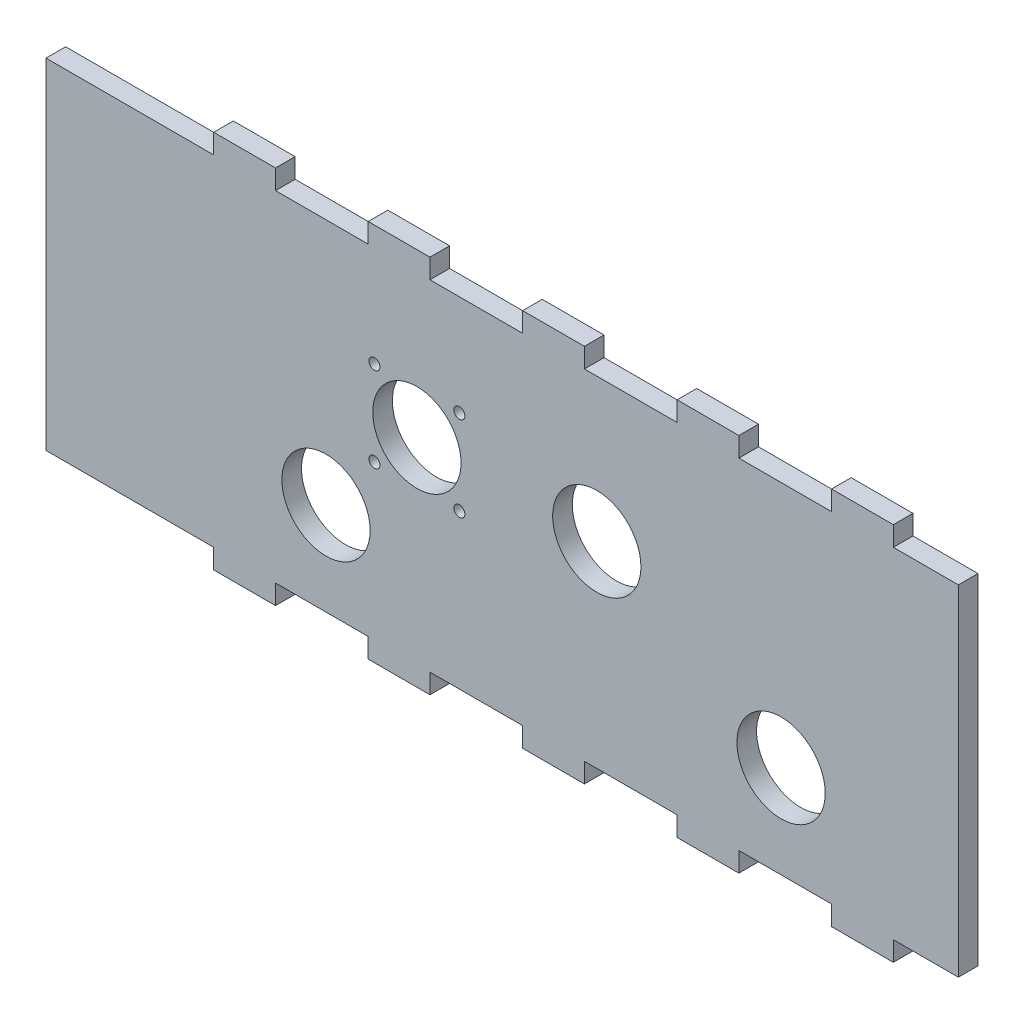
from build123d import *

# Parameters (mm, degrees)
SKETCH1_R           = 14.2875
SKETCH1_R_2         = 1.778
BOSS_EXTRUDE1_DEPTH = 6.35


with BuildPart() as part:
    # Sketch1 → Boss-Extrude1 (new body)
    with BuildSketch(Plane.XY):
        Polygon((154.3, 0), (154.3, -6.35), (174.3, -6.35), (174.3, 0), (204.3, 0), (204.3, -6.35), (224.3, -6.35), (224.3, 0), (254.3, 0), (254.3, -6.35), (274.3, -6.35), (274.3, 0), (295.36, 0), (295.36, 110), (274.3, 110), (274.3, 116.35), (254.3, 116.35), (254.3, 110), (224.3, 110), (224.3, 116.35), (204.3, 116.35), (204.3, 110), (174.3, 110), (174.3, 116.35), (154.3, 116.35), (154.3, 110), (124.3, 110), (124.3, 116.35), (104.3, 116.35), (104.3, 110), (74.3, 110), (74.3, 116.35), (54.3, 116.35), (54.3, 110), (0, 110), (0, 0), (54.3, 0), (54.3, -6.35), (74.3, -6.35), (74.3, 0), (104.3, 0), (104.3, -6.35), (124.3, -6.35), (124.3, 0), align=None)
        with Locations((90.64, 30)):
            Circle(SKETCH1_R, mode=Mode.SUBTRACT)
        with Locations((237.96, 30)):
            Circle(SKETCH1_R, mode=Mode.SUBTRACT)
        with Locations((178.306374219, 63.670386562)):
            Circle(SKETCH1_R, mode=Mode.SUBTRACT)
        with Locations((120.066374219, 63.670386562)):
            Circle(SKETCH1_R, mode=Mode.SUBTRACT)
        with Locations((106.317602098, 77.419158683)):
            Circle(SKETCH1_R_2, mode=Mode.SUBTRACT)
        with Locations((106.317602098, 49.921614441)):
            Circle(SKETCH1_R_2, mode=Mode.SUBTRACT)
        with Locations((133.815146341, 77.419158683)):
            Circle(SKETCH1_R_2, mode=Mode.SUBTRACT)
        with Locations((133.815146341, 49.921614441)):
            Circle(SKETCH1_R_2, mode=Mode.SUBTRACT)
    extrude(amount=BOSS_EXTRUDE1_DEPTH)


solid = part.part
